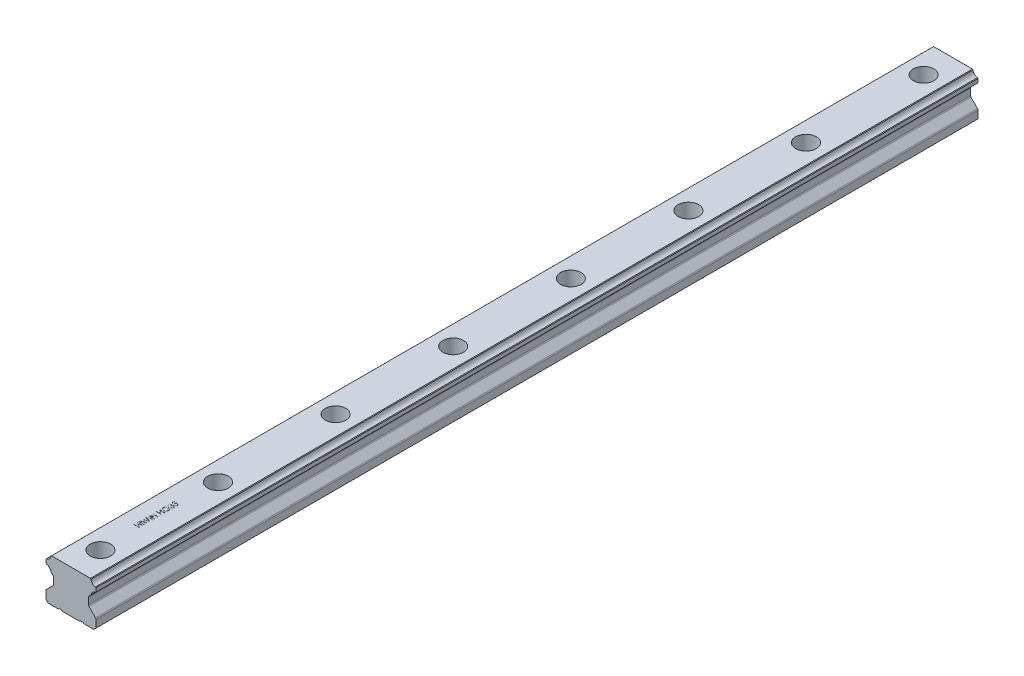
from build123d import *

# Parameters (mm, degrees)
EXTRUDE_1_DEPTH              = 600
HOLE_WIZARD_M8_1_D           = 9
HOLE_WIZARD_M8_1_CBORE_D     = 14
HOLE_WIZARD_M8_1_CBORE_DEPTH = 12
PATTERN_LINEAR_1_COUNT       = 8
PATTERN_LINEAR_1_PITCH       = 80
SKETCH_6_W                   = 3.5
SKETCH_6_H                   = 0.314102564
CUT_EXTRUDE_1_DEPTH          = 0.1


with BuildPart() as part:
    # Sketch 1 → Extrude 1 (new body)
    with BuildSketch(Plane.XY):
        with BuildLine():
            Line((-12.251471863, 11.889929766), (-16.648528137, 7.492873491))
            ThreePointArc((-16.648528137, 7.492873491), (-16.908655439, 7.103565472), (-17, 6.644345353))
            Line((-17, 6.644345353), (-17, 1.5))
            Line((-17, 1.5), (-15.5, 0))
            Line((-15.5, 0), (-8.75, 0))
            Line((-8.75, 0), (-8.25, 0.5))
            Line((-8.25, 0.5), (-6.35, 0.5))
            Line((-6.35, 0.5), (-5.85, 0))
            Line((-5.85, 0), (5.85, 0))
            Line((5.85, 0), (6.35, 0.5))
            Line((6.35, 0.5), (8.25, 0.5))
            Line((8.25, 0.5), (8.75, 0))
            Line((8.75, 0), (15.5, 0))
            Line((15.5, 0), (17, 1.5))
            Line((17, 1.5), (17, 6.644345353))
            ThreePointArc((17, 6.644345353), (16.908655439, 7.103565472), (16.648528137, 7.492873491))
            Line((16.648528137, 7.492873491), (12.251471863, 11.889929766))
            ThreePointArc((12.251471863, 11.889929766), (11.991344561, 12.279237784), (11.9, 12.738457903))
            Line((11.9, 12.738457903), (11.9, 17.141522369))
            ThreePointArc((11.9, 17.141522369), (11.991344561, 17.600742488), (12.251471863, 17.990050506))
            Line((12.251471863, 17.990050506), (13.625943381, 19.364522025))
            ThreePointArc((13.625943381, 19.364522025), (14.569476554, 21.429523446), (16.634477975, 22.373056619))
            Line((16.634477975, 22.373056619), (17, 22.738578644))
            Line((17, 22.738578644), (17, 25.251421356))
            Line((17, 25.251421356), (16.622602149, 25.628819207))
            ThreePointArc((16.622602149, 25.628819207), (14.569476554, 26.571476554), (13.626819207, 28.624602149))
            Line((13.626819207, 28.624602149), (13.251421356, 29))
            Line((13.251421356, 29), (-13.251421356, 29))
            Line((-13.251421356, 29), (-13.626819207, 28.624602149))
            ThreePointArc((-13.626819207, 28.624602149), (-14.569476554, 26.571476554), (-16.622602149, 25.628819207))
            Line((-16.622602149, 25.628819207), (-17, 25.251421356))
            Line((-17, 25.251421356), (-17, 22.738578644))
            Line((-17, 22.738578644), (-16.634477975, 22.373056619))
            ThreePointArc((-16.634477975, 22.373056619), (-14.569476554, 21.429523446), (-13.625943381, 19.364522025))
            Line((-13.625943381, 19.364522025), (-12.251471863, 17.990050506))
            ThreePointArc((-12.251471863, 17.990050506), (-11.991344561, 17.600742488), (-11.9, 17.141522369))
            Line((-11.9, 17.141522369), (-11.9, 12.738457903))
            ThreePointArc((-11.9, 12.738457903), (-11.991344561, 12.279237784), (-12.251471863, 11.889929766))
        make_face()
    extrude(amount=-EXTRUDE_1_DEPTH)

    # Hole Wizard M8 _1 (through all)
    with Locations(Plane(origin=(-5.47708742, 29, -56.116248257), x_dir=(-1, 0, 0), z_dir=(0, 1, 0))):
        with Locations((-5.47708742, 36.116248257)):
            hole_wizard_m8_1 = CounterBoreHole(HOLE_WIZARD_M8_1_D / 2, HOLE_WIZARD_M8_1_CBORE_D / 2, HOLE_WIZARD_M8_1_CBORE_DEPTH)

    # Pattern Linear 1: Hole Wizard M8 _1 ×8
    with Locations(*[(0, 0, -i * PATTERN_LINEAR_1_PITCH) for i in range(1, PATTERN_LINEAR_1_COUNT)]):
        add(hole_wizard_m8_1, mode=Mode.SUBTRACT)

    # Sketch 6 → Cut-Extrude 1 (cut)
    with BuildSketch(Plane(origin=(0, 29, 0), x_dir=(1, 0, 0), z_dir=(0, 1, 0))):
        Polygon((-3.5, 46.403846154), (-3.5, 46.717948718), (-2.064102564, 46.717948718), (-2.064102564, 48.512820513), (-3.5, 48.512820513), (-3.5, 48.826923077), (0, 48.826923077), (0, 48.512820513), (-1.705128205, 48.512820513), (-1.705128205, 46.717948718), (0, 46.717948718), (0, 46.403846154), align=None)
        with Locations((-1.75, 49.881410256)):
            Rectangle(SKETCH_6_W, SKETCH_6_H)
        Polygon((-3.5, 50.576923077), (-3.5, 50.901542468), (-0.933193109, 51.586538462), (-3.5, 52.605268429), (-3.5, 52.650841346), (-0.950721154, 53.650641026), (-3.5, 54.339142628), (-3.5, 54.66025641), (0, 53.716546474), (0, 53.671674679), (-2.676883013, 52.618589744), (0, 51.552884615), (0, 51.508012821), align=None)
        with Locations((-1.75, 55.625)):
            Rectangle(SKETCH_6_W, SKETCH_6_H)
        Polygon((0, 56.544871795), (-3.5, 56.544871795), (-3.5, 56.610777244), (-0.745292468, 58.923076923), (-3.5, 58.923076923), (-3.5, 59.237179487), (0, 59.237179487), (0, 59.165665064), (-2.748397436, 56.858974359), (0, 56.858974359), align=None)
        Polygon((-3.5, 61.480769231), (-3.5, 61.794871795), (-2.064102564, 61.794871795), (-2.064102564, 63.58974359), (-3.5, 63.58974359), (-3.5, 63.903846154), (0, 63.903846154), (0, 63.58974359), (-1.705128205, 63.58974359), (-1.705128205, 61.794871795), (0, 61.794871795), (0, 61.480769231), align=None)
        with BuildLine():
            Line((-2.902644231, 68.076923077), (-2.647435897, 67.807692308))
            add(Edge.make_bspline(
                [(-2.647435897, 67.807692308), (-2.69328212, 67.758983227), (-2.783881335, 67.662726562), (-2.901244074, 67.50552662), (-3.002777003, 67.342170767), (-3.084772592, 67.172394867), (-3.149094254, 67.000650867), (-3.195850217, 66.829891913), (-3.225460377, 66.661223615), (-3.229016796, 66.549059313), (-3.230769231, 66.493790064)],
                knots=[0, 0, 0, 0, 1.089067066, 2.152164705, 3.18986567, 4.218445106, 5.218487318, 6.173592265, 7.100032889, 8, 8, 8, 8], degree=3))
            add(Edge.make_bspline(
                [(-3.230769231, 66.493790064), (-3.230355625, 66.459875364), (-3.229529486, 66.392133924), (-3.218985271, 66.29151198), (-3.203820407, 66.191945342), (-3.181878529, 66.093621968), (-3.15406947, 65.99635068), (-3.119284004, 65.900469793), (-3.078728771, 65.805800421), (-3.031866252, 65.713234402), (-2.980386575, 65.623493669), (-2.923337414, 65.538737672), (-2.862550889, 65.458421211), (-2.796491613, 65.384072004), (-2.725807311, 65.31519549), (-2.651770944, 65.250524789), (-2.572926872, 65.191265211), (-2.489599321, 65.138479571), (-2.403726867, 65.090811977), (-2.316037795, 65.049619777), (-2.227346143, 65.013809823), (-2.136984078, 64.986535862), (-2.045883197, 64.963434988), (-1.953566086, 64.947353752), (-1.859791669, 64.938257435), (-1.796993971, 64.936686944), (-1.765424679, 64.935897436)],
                knots=[0, 0, 0, 0, 1.028150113, 2.053633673, 3.06513288, 4.081487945, 5.106702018, 6.131327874, 7.172780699, 8.228344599, 9.276313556, 10.308389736, 11.324843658, 12.329040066, 13.321460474, 14.316307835, 15.308626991, 16.309440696, 17.305625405, 18.28535951, 19.246194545, 20.203493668, 21.145557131, 22.095268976, 23.042464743, 24, 24, 24, 24], degree=3))
            add(Edge.make_bspline(
                [(-1.765424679, 64.935897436), (-1.733154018, 64.936653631), (-1.668700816, 64.938163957), (-1.572504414, 64.947817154), (-1.477747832, 64.965772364), (-1.384282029, 64.989584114), (-1.291920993, 65.019856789), (-1.20076111, 65.057049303), (-1.110811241, 65.101355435), (-1.022964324, 65.152526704), (-0.937464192, 65.209036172), (-0.856251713, 65.271187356), (-0.780271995, 65.339084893), (-0.708415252, 65.411483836), (-0.641134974, 65.489043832), (-0.579242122, 65.572517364), (-0.521779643, 65.660735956), (-0.469378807, 65.753738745), (-0.42257144, 65.850542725), (-0.38094723, 65.949799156), (-0.346667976, 66.051827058), (-0.31872985, 66.156089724), (-0.295829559, 66.262463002), (-0.281097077, 66.371486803), (-0.270406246, 66.482359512), (-0.269624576, 66.557098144), (-0.269230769, 66.594751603)],
                knots=[0, 0, 0, 0, 0.935915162, 1.869274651, 2.799799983, 3.730201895, 4.664668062, 5.616159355, 6.583070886, 7.570012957, 8.562524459, 9.553461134, 10.53281078, 11.515274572, 12.509912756, 13.507571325, 14.526460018, 15.561318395, 16.601025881, 17.643204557, 18.680545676, 19.719612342, 20.772381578, 21.833430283, 22.908478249, 24, 24, 24, 24], degree=3))
            add(Edge.make_bspline(
                [(-0.269230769, 66.594751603), (-0.270178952, 66.640130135), (-0.272040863, 66.729238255), (-0.286546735, 66.860222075), (-0.309173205, 66.986034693), (-0.342412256, 67.106266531), (-0.384484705, 67.221353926), (-0.436513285, 67.330872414), (-0.497950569, 67.435124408), (-0.567552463, 67.533658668), (-0.645100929, 67.624132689), (-0.728035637, 67.706474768), (-0.817431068, 67.77785339), (-0.911954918, 67.840400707), (-1.012511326, 67.892097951), (-1.118540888, 67.934543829), (-1.230109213, 67.967076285), (-1.307200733, 67.980431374), (-1.346153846, 67.987179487)],
                knots=[0, 0, 0, 0, 1.130199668, 2.219330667, 3.279027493, 4.311506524, 5.322739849, 6.327972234, 7.327472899, 8.33386792, 9.329086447, 10.29244429, 11.240784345, 12.174119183, 13.111530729, 14.052100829, 15.015757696, 16, 16, 16, 16], degree=3))
            Line((-1.346153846, 67.987179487), (-1.346153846, 66.820512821))
            Line((-1.346153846, 66.820512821), (-1.705128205, 66.820512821))
            Line((-1.705128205, 66.820512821), (-1.705128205, 68.301282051))
            add(Edge.make_bspline(
                [(-1.705128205, 68.301282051), (-1.638220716, 68.299576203), (-1.507270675, 68.296237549), (-1.316300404, 68.272818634), (-1.13592871, 68.235002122), (-0.965965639, 68.18334181), (-0.806652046, 68.116466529), (-0.65782618, 68.035094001), (-0.520449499, 67.93792188), (-0.393400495, 67.828411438), (-0.280071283, 67.705511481), (-0.180465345, 67.572542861), (-0.09656273, 67.429285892), (-0.028302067, 67.275876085), (0.024971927, 67.112815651), (0.062743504, 66.939727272), (0.085373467, 66.756845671), (0.088264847, 66.631508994), (0.08974359, 66.567407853)],
                knots=[0, 0, 0, 0, 1.140356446, 2.231883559, 3.274166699, 4.278491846, 5.25512956, 6.21435461, 7.1637429, 8.11826594, 9.068280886, 10.0076534, 10.945064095, 11.891975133, 12.864533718, 13.863980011, 14.907571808, 16, 16, 16, 16], degree=3))
            add(Edge.make_bspline(
                [(0.08974359, 66.567407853), (0.089174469, 66.527897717), (0.088051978, 66.449970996), (0.080074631, 66.334880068), (0.067794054, 66.222962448), (0.049248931, 66.114234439), (0.026534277, 66.008296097), (-0.002552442, 65.905676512), (-0.036221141, 65.80598477), (-0.074516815, 65.709066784), (-0.118888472, 65.615802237), (-0.168198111, 65.52577572), (-0.222191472, 65.438489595), (-0.281802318, 65.35453843), (-0.346584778, 65.273484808), (-0.416668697, 65.195851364), (-0.491839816, 65.121203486), (-0.545218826, 65.074443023), (-0.572115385, 65.05088141)],
                knots=[0, 0, 0, 0, 1.107784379, 2.184907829, 3.233506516, 4.263428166, 5.276301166, 6.270063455, 7.25232949, 8.225834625, 9.190232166, 10.146266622, 11.1027726, 12.066435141, 13.031522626, 14.010570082, 14.99756817, 16, 16, 16, 16], degree=3))
            add(Edge.make_bspline(
                [(-0.572115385, 65.05088141), (-0.614786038, 65.016695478), (-0.699419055, 64.948891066), (-0.835018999, 64.861612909), (-0.975420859, 64.787211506), (-1.121015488, 64.726843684), (-1.271666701, 64.679705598), (-1.427181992, 64.645899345), (-1.587761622, 64.626092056), (-1.696426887, 64.623238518), (-1.751402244, 64.621794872)],
                knots=[0, 0, 0, 0, 1.023165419, 2.029347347, 3.013907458, 3.994755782, 4.975994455, 5.96558838, 6.970761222, 8, 8, 8, 8], degree=3))
            add(Edge.make_bspline(
                [(-1.751402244, 64.621794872), (-1.792568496, 64.62232711), (-1.874377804, 64.623384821), (-1.99583511, 64.636210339), (-2.115135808, 64.654611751), (-2.232182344, 64.681658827), (-2.347053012, 64.715755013), (-2.45980069, 64.758308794), (-2.570493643, 64.807852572), (-2.67836343, 64.865442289), (-2.782003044, 64.929511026), (-2.880905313, 64.999118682), (-2.973467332, 65.074802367), (-3.059903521, 65.156782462), (-3.141494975, 65.243406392), (-3.216537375, 65.336492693), (-3.286205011, 65.434631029), (-3.349159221, 65.538582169), (-3.405727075, 65.6467058), (-3.455315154, 65.758766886), (-3.496298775, 65.874724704), (-3.531072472, 65.993712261), (-3.556787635, 66.11662974), (-3.575436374, 66.242585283), (-3.588196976, 66.372235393), (-3.589223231, 66.459871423), (-3.58974359, 66.504306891)],
                knots=[0, 0, 0, 0, 1.00895651, 2.005089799, 2.991467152, 3.967318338, 4.948153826, 5.927364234, 6.919980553, 7.91976625, 8.923240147, 9.905815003, 10.88314567, 11.851989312, 12.825009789, 13.798721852, 14.781296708, 15.773896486, 16.776076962, 17.771600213, 18.775744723, 19.78957137, 20.808953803, 21.851964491, 22.910847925, 24, 24, 24, 24], degree=3))
            add(Edge.make_bspline(
                [(-3.58974359, 66.504306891), (-3.589164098, 66.540545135), (-3.588015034, 66.612401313), (-3.580050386, 66.719327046), (-3.567426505, 66.82460006), (-3.550199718, 66.92837645), (-3.526736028, 67.030302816), (-3.498657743, 67.130669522), (-3.46596592, 67.229622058), (-3.426977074, 67.326850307), (-3.382723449, 67.423008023), (-3.332910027, 67.518629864), (-3.276685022, 67.61338911), (-3.213881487, 67.707450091), (-3.145578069, 67.801405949), (-3.069821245, 67.893770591), (-2.989598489, 67.986773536), (-2.931916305, 68.04657535), (-2.902644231, 68.076923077)],
                knots=[0, 0, 0, 0, 0.985871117, 1.954866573, 2.915460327, 3.869826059, 4.81536089, 5.759505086, 6.70452669, 7.649098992, 8.607881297, 9.583363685, 10.581137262, 11.603961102, 12.659522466, 13.73993555, 14.853081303, 16, 16, 16, 16], degree=3))
        make_face()
        with BuildLine():
            Line((-2.692307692, 69.153846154), (-2.692307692, 68.83974359))
            add(Edge.make_bspline(
                [(-2.692307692, 68.83974359), (-2.727540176, 68.84825314), (-2.796416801, 68.864888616), (-2.894824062, 68.899586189), (-2.987947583, 68.937385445), (-3.074043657, 68.982774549), (-3.154842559, 69.032283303), (-3.228511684, 69.089006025), (-3.296924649, 69.150325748), (-3.357637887, 69.218150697), (-3.412615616, 69.289279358), (-3.459490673, 69.364713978), (-3.499814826, 69.442936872), (-3.533035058, 69.524490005), (-3.558060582, 69.609616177), (-3.576217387, 69.6975458), (-3.588008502, 69.7885093), (-3.589159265, 69.850256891), (-3.58974359, 69.881610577)],
                knots=[0, 0, 0, 0, 1.162005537, 2.271625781, 3.343758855, 4.383309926, 5.390229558, 6.379919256, 7.361854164, 8.333198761, 9.295911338, 10.242430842, 11.177959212, 12.116337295, 13.062827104, 14.020064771, 14.994644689, 16, 16, 16, 16], degree=3))
            add(Edge.make_bspline(
                [(-3.58974359, 69.881610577), (-3.588364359, 69.927293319), (-3.585635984, 70.01766233), (-3.560721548, 70.150425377), (-3.521296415, 70.278452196), (-3.466822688, 70.400341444), (-3.399635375, 70.513559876), (-3.319670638, 70.614296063), (-3.228471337, 70.701184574), (-3.127738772, 70.774078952), (-3.020083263, 70.831153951), (-2.909283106, 70.873240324), (-2.795601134, 70.898862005), (-2.718843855, 70.902182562), (-2.680388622, 70.903846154)],
                knots=[0, 0, 0, 0, 1.083050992, 2.142477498, 3.193116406, 4.255571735, 5.30263384, 6.308962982, 7.297363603, 8.282367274, 9.249857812, 10.179914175, 11.08814088, 12, 12, 12, 12], degree=3))
            add(Edge.make_bspline(
                [(-2.680388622, 70.903846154), (-2.643381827, 70.902682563), (-2.570965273, 70.900405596), (-2.465243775, 70.88107189), (-2.365602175, 70.848535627), (-2.271621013, 70.803465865), (-2.183896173, 70.745124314), (-2.102230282, 70.674451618), (-2.026261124, 70.590948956), (-1.982741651, 70.527670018), (-1.960336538, 70.495092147)],
                knots=[0, 0, 0, 0, 1.024540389, 2.004866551, 2.965041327, 3.920577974, 4.882998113, 5.874504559, 6.905732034, 8, 8, 8, 8], degree=3))
            add(Edge.make_bspline(
                [(-1.960336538, 70.495092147), (-1.942423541, 70.532371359), (-1.906875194, 70.606351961), (-1.836051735, 70.706173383), (-1.75628694, 70.79817187), (-1.693344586, 70.848874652), (-1.661658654, 70.874399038)],
                knots=[0, 0, 0, 0, 1.015663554, 2.015584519, 3.001021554, 4, 4, 4, 4], degree=3))
            add(Edge.make_bspline(
                [(-1.661658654, 70.874399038), (-1.638600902, 70.891240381), (-1.592862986, 70.924647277), (-1.51932656, 70.965882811), (-1.444975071, 71.003291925), (-1.367815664, 71.032442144), (-1.288742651, 71.055016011), (-1.207620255, 71.071152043), (-1.124382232, 71.081176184), (-1.068069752, 71.082611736), (-1.039763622, 71.083333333)],
                knots=[0, 0, 0, 0, 1.025084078, 2.033381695, 3.024893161, 4.013698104, 4.991890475, 5.976764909, 6.982997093, 8, 8, 8, 8], degree=3))
            add(Edge.make_bspline(
                [(-1.039763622, 71.083333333), (-0.990754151, 71.081538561), (-0.892965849, 71.077957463), (-0.74848737, 71.045957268), (-0.60727652, 70.996328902), (-0.47214511, 70.925930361), (-0.345832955, 70.839746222), (-0.231982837, 70.738346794), (-0.135655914, 70.620282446), (-0.054197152, 70.489832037), (0.01031173, 70.347893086), (0.056807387, 70.196698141), (0.084695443, 70.037122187), (0.088041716, 69.927996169), (0.08974359, 69.872495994)],
                knots=[0, 0, 0, 0, 0.955697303, 1.906897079, 2.875188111, 3.870982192, 4.871999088, 5.854111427, 6.836107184, 7.836239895, 8.848948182, 9.870701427, 10.917064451, 12, 12, 12, 12], degree=3))
            add(Edge.make_bspline(
                [(0.08974359, 69.872495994), (0.088867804, 69.835079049), (0.087144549, 69.761454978), (0.075573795, 69.653177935), (0.053866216, 69.550041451), (0.02656593, 69.45104403), (-0.011179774, 69.357679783), (-0.056179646, 69.268605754), (-0.109587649, 69.184212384), (-0.171493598, 69.105000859), (-0.240788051, 69.031055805), (-0.318622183, 68.964261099), (-0.403543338, 68.903877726), (-0.496315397, 68.850289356), (-0.596678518, 68.803270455), (-0.705034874, 68.763832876), (-0.820544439, 68.729398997), (-0.901018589, 68.713358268), (-0.942307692, 68.705128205)],
                knots=[0, 0, 0, 0, 1.048603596, 2.063302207, 3.045874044, 3.999447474, 4.937100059, 5.862643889, 6.7929026, 7.7308982, 8.676022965, 9.627908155, 10.600123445, 11.591992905, 12.626222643, 13.701663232, 14.820785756, 16, 16, 16, 16], degree=3))
            Line((-0.942307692, 68.705128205), (-0.942307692, 69.019230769))
            add(Edge.make_bspline(
                [(-0.942307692, 69.019230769), (-0.915358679, 69.027414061), (-0.862940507, 69.043331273), (-0.787500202, 69.070425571), (-0.718342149, 69.101293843), (-0.654959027, 69.134408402), (-0.596726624, 69.169186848), (-0.545184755, 69.208101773), (-0.498069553, 69.248270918), (-0.471524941, 69.278550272), (-0.458533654, 69.293369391)],
                knots=[0, 0, 0, 0, 1.198163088, 2.33053128, 3.407730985, 4.417276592, 5.372219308, 6.28897303, 7.162600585, 8, 8, 8, 8], degree=3))
            add(Edge.make_bspline(
                [(-0.458533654, 69.293369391), (-0.44343155, 69.312968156), (-0.413273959, 69.35210519), (-0.374678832, 69.415840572), (-0.341642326, 69.48310519), (-0.31478887, 69.554459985), (-0.294631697, 69.629914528), (-0.280123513, 69.709162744), (-0.270545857, 69.792334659), (-0.269675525, 69.849097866), (-0.269230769, 69.878104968)],
                knots=[0, 0, 0, 0, 0.946083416, 1.889246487, 2.84504177, 3.809995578, 4.801312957, 5.829064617, 6.89060985, 8, 8, 8, 8], degree=3))
            add(Edge.make_bspline(
                [(-0.269230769, 69.878104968), (-0.269846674, 69.910858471), (-0.271051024, 69.974905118), (-0.282126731, 70.068359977), (-0.298257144, 70.157267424), (-0.323170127, 70.24064035), (-0.353950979, 70.319570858), (-0.392599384, 70.392952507), (-0.437944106, 70.461748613), (-0.489483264, 70.525078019), (-0.545904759, 70.582023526), (-0.60491783, 70.63216304), (-0.66627366, 70.674787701), (-0.730311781, 70.709171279), (-0.79676701, 70.736321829), (-0.865825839, 70.75480503), (-0.936923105, 70.767656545), (-0.985252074, 70.768703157), (-1.009615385, 70.769230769)],
                knots=[0, 0, 0, 0, 1.217147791, 2.380027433, 3.494444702, 4.572153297, 5.609568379, 6.639424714, 7.649109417, 8.668170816, 9.669597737, 10.625200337, 11.543417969, 12.441394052, 13.322311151, 14.205496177, 15.095365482, 16, 16, 16, 16], degree=3))
            add(Edge.make_bspline(
                [(-1.009615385, 70.769230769), (-1.042224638, 70.767697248), (-1.107280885, 70.764637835), (-1.2030297, 70.741377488), (-1.295316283, 70.702773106), (-1.38294536, 70.649787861), (-1.463170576, 70.583711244), (-1.535262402, 70.50766728), (-1.594692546, 70.419587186), (-1.635791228, 70.338580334), (-1.663826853, 70.266813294), (-1.68250216, 70.205398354), (-1.698315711, 70.136641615), (-1.713028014, 70.061375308), (-1.725549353, 69.979032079), (-1.735991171, 69.889701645), (-1.744346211, 69.793365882), (-1.748077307, 69.726674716), (-1.75, 69.692307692)],
                knots=[0, 0, 0, 0, 1.070505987, 2.135685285, 3.216438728, 4.346150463, 5.486482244, 6.621737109, 7.7759408, 8.963942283, 9.59839197, 10.305095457, 11.070459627, 11.915156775, 12.823989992, 13.805807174, 14.869297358, 16, 16, 16, 16], degree=3))
            Line((-1.75, 69.692307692), (-2.108974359, 69.692307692))
            add(Edge.make_bspline(
                [(-2.108974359, 69.692307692), (-2.109815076, 69.73559321), (-2.111461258, 69.820349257), (-2.127376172, 69.944483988), (-2.152925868, 70.062682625), (-2.189431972, 70.173246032), (-2.232431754, 70.273826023), (-2.282116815, 70.361437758), (-2.338352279, 70.433774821), (-2.400061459, 70.49159294), (-2.465885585, 70.535538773), (-2.534911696, 70.567143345), (-2.607413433, 70.585979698), (-2.65691109, 70.588484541), (-2.681790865, 70.58974359)],
                knots=[0, 0, 0, 0, 1.322091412, 2.58874672, 3.817242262, 5.011895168, 6.140903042, 7.155122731, 8.080855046, 8.929742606, 9.727943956, 10.488587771, 11.240295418, 12, 12, 12, 12], degree=3))
            add(Edge.make_bspline(
                [(-2.681790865, 70.58974359), (-2.700071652, 70.589338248), (-2.73644041, 70.58853184), (-2.789741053, 70.577957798), (-2.841409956, 70.562798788), (-2.890858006, 70.540789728), (-2.938186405, 70.512273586), (-2.983914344, 70.477877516), (-3.027450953, 70.436621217), (-3.069020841, 70.390413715), (-3.106837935, 70.339246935), (-3.13993415, 70.284314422), (-3.168009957, 70.225838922), (-3.191238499, 70.16419501), (-3.208692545, 70.09909542), (-3.221229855, 70.03087), (-3.229067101, 69.959382), (-3.230195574, 69.910610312), (-3.230769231, 69.885817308)],
                knots=[0, 0, 0, 0, 0.884325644, 1.759323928, 2.622595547, 3.489424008, 4.37295195, 5.294616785, 6.255907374, 7.274251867, 8.302369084, 9.333474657, 10.37669385, 11.44084034, 12.520297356, 13.637342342, 14.798947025, 16, 16, 16, 16], degree=3))
            add(Edge.make_bspline(
                [(-3.230769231, 69.885817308), (-3.229377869, 69.84596564), (-3.226660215, 69.768126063), (-3.202857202, 69.655911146), (-3.164879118, 69.551591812), (-3.119546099, 69.471853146), (-3.074795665, 69.412970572), (-3.035713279, 69.370893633), (-2.992280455, 69.329573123), (-2.94182208, 69.291727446), (-2.887755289, 69.25345347), (-2.827331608, 69.218608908), (-2.762127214, 69.184749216), (-2.716031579, 69.164346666), (-2.692307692, 69.153846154)],
                knots=[0, 0, 0, 0, 1.472543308, 2.876219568, 4.221790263, 5.565193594, 6.249813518, 6.953379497, 7.687249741, 8.463570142, 9.283606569, 10.136032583, 11.040678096, 12, 12, 12, 12], degree=3))
        make_face()
        with BuildLine():
            Line((-3.5, 73.596153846), (-3.141025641, 73.596153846))
            Line((-3.141025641, 73.596153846), (-3.141025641, 72.405649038))
            Line((-3.141025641, 72.405649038), (-2.220452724, 72.217047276))
            add(Edge.make_bspline(
                [(-2.220452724, 72.217047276), (-2.230682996, 72.25410315), (-2.25050253, 72.325893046), (-2.2725083, 72.431852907), (-2.285773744, 72.53244511), (-2.287585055, 72.597720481), (-2.288461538, 72.629306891)],
                knots=[0, 0, 0, 0, 1.100273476, 2.13160584, 3.095893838, 4, 4, 4, 4], degree=3))
            add(Edge.make_bspline(
                [(-2.288461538, 72.629306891), (-2.28764354, 72.668397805), (-2.28603515, 72.745260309), (-2.269673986, 72.857544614), (-2.245976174, 72.96527195), (-2.209465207, 73.066851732), (-2.164878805, 73.163891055), (-2.108721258, 73.254723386), (-2.04315746, 73.34062356), (-1.968525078, 73.420997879), (-1.885534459, 73.493570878), (-1.795933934, 73.556634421), (-1.701678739, 73.611677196), (-1.600559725, 73.654605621), (-1.494484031, 73.689639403), (-1.382227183, 73.712740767), (-1.264785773, 73.728171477), (-1.18448027, 73.729891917), (-1.143529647, 73.730769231)],
                knots=[0, 0, 0, 0, 1.052805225, 2.070078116, 3.052532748, 4.020689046, 4.973125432, 5.925915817, 6.89216474, 7.881560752, 8.877013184, 9.857446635, 10.830895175, 11.812622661, 12.812548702, 13.836681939, 14.896847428, 16, 16, 16, 16], degree=3))
            add(Edge.make_bspline(
                [(-1.143529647, 73.730769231), (-1.115007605, 73.730103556), (-1.058348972, 73.728781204), (-0.974202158, 73.7220714), (-0.891849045, 73.709103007), (-0.811440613, 73.69190289), (-0.732901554, 73.668941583), (-0.65579213, 73.642084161), (-0.580956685, 73.608702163), (-0.508064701, 73.571694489), (-0.437950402, 73.530715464), (-0.372294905, 73.484635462), (-0.309599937, 73.436755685), (-0.251727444, 73.384438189), (-0.198452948, 73.328277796), (-0.149513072, 73.268586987), (-0.104029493, 73.205907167), (-0.063861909, 73.139251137), (-0.026898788, 73.070108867), (0.003424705, 72.997480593), (0.030535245, 72.923019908), (0.05214477, 72.845655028), (0.069077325, 72.765561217), (0.080577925, 72.682606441), (0.088954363, 72.597225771), (0.08947872, 72.539350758), (0.08974359, 72.510116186)],
                knots=[0, 0, 0, 0, 1.056393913, 2.098511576, 3.122979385, 4.141471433, 5.141222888, 6.151259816, 7.162667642, 8.172852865, 9.177685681, 10.166741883, 11.141342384, 12.097242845, 13.052202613, 14.005160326, 14.953864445, 15.917140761, 16.884916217, 17.854238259, 18.828761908, 19.81781811, 20.826036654, 21.857789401, 22.917898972, 24, 24, 24, 24], degree=3))
            add(Edge.make_bspline(
                [(0.08974359, 72.510116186), (0.089050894, 72.475242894), (0.087688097, 72.406633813), (0.073496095, 72.30610057), (0.053035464, 72.209432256), (0.022721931, 72.117043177), (-0.016971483, 72.029318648), (-0.064133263, 71.945002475), (-0.12027864, 71.865139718), (-0.184894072, 71.790276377), (-0.255892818, 71.721460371), (-0.332202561, 71.65905751), (-0.413920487, 71.604193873), (-0.500780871, 71.556670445), (-0.592629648, 71.516184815), (-0.689749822, 71.484366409), (-0.791650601, 71.45868899), (-0.861804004, 71.447825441), (-0.897435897, 71.442307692)],
                knots=[0, 0, 0, 0, 1.046872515, 2.059598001, 3.044168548, 4.012104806, 4.973680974, 5.932408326, 6.910122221, 7.900780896, 8.89867654, 9.876692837, 10.858029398, 11.85084981, 12.847361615, 13.868568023, 14.917415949, 16, 16, 16, 16], degree=3))
            Line((-0.897435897, 71.442307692), (-0.897435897, 71.756410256))
            add(Edge.make_bspline(
                [(-0.897435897, 71.756410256), (-0.86405597, 71.764133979), (-0.799897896, 71.778979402), (-0.709812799, 71.811649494), (-0.62950762, 71.851206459), (-0.558491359, 71.899340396), (-0.495464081, 71.955133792), (-0.43989307, 72.019990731), (-0.389697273, 72.092289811), (-0.347784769, 72.17267219), (-0.312479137, 72.257640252), (-0.287283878, 72.346063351), (-0.272032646, 72.436668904), (-0.270168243, 72.497671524), (-0.269230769, 72.528345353)],
                knots=[0, 0, 0, 0, 1.13623081, 2.183898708, 3.172478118, 4.09966615, 5.022692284, 5.957376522, 6.927682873, 7.937366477, 8.960015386, 9.976409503, 10.982481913, 12, 12, 12, 12], degree=3))
            add(Edge.make_bspline(
                [(-0.269230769, 72.528345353), (-0.270058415, 72.558301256), (-0.271688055, 72.617284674), (-0.284028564, 72.704132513), (-0.303533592, 72.787735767), (-0.33085902, 72.868242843), (-0.367008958, 72.945258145), (-0.411417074, 73.018672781), (-0.462975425, 73.089532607), (-0.521904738, 73.1559727), (-0.586881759, 73.216808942), (-0.656357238, 73.270565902), (-0.730474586, 73.315342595), (-0.807947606, 73.353076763), (-0.889626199, 73.381730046), (-0.975127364, 73.402171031), (-1.064662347, 73.414174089), (-1.125731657, 73.415825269), (-1.156850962, 73.416666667)],
                knots=[0, 0, 0, 0, 1.027268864, 2.022700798, 3.002744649, 3.968653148, 4.933396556, 5.915045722, 6.907600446, 7.935526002, 8.956456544, 9.95700807, 10.942805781, 11.92166854, 12.907987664, 13.905483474, 14.932689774, 16, 16, 16, 16], degree=3))
            add(Edge.make_bspline(
                [(-1.156850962, 73.416666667), (-1.184930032, 73.416028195), (-1.239659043, 73.414783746), (-1.320009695, 73.404010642), (-1.396158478, 73.386014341), (-1.468436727, 73.360391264), (-1.536613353, 73.328412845), (-1.600538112, 73.288262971), (-1.660812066, 73.241651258), (-1.715884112, 73.187233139), (-1.766793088, 73.12803749), (-1.810034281, 73.062543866), (-1.846807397, 72.992500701), (-1.876936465, 72.917778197), (-1.900936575, 72.838284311), (-1.917523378, 72.753976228), (-1.92744867, 72.664834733), (-1.928795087, 72.603859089), (-1.929487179, 72.572516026)],
                knots=[0, 0, 0, 0, 1.045723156, 2.038222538, 3.013889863, 3.95567481, 4.890389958, 5.81331128, 6.76251276, 7.723027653, 8.692928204, 9.666105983, 10.639751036, 11.635719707, 12.66315958, 13.728667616, 14.832476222, 16, 16, 16, 16], degree=3))
            add(Edge.make_bspline(
                [(-1.929487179, 72.572516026), (-1.928906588, 72.545387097), (-1.927707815, 72.489372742), (-1.918881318, 72.403449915), (-1.904642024, 72.313158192), (-1.885055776, 72.218843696), (-1.859424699, 72.120223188), (-1.828710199, 72.017504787), (-1.7919882, 71.910472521), (-1.764255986, 71.838354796), (-1.75, 71.801282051)],
                knots=[0, 0, 0, 0, 0.817624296, 1.688186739, 2.600797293, 3.572016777, 4.590301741, 5.671205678, 6.80286297, 8, 8, 8, 8], degree=3))
            Line((-1.75, 71.801282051), (-3.5, 72.16025641))
            Line((-3.5, 72.16025641), (-3.5, 73.596153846))
        make_face()
    extrude(amount=-CUT_EXTRUDE_1_DEPTH, mode=Mode.SUBTRACT)


solid = part.part
